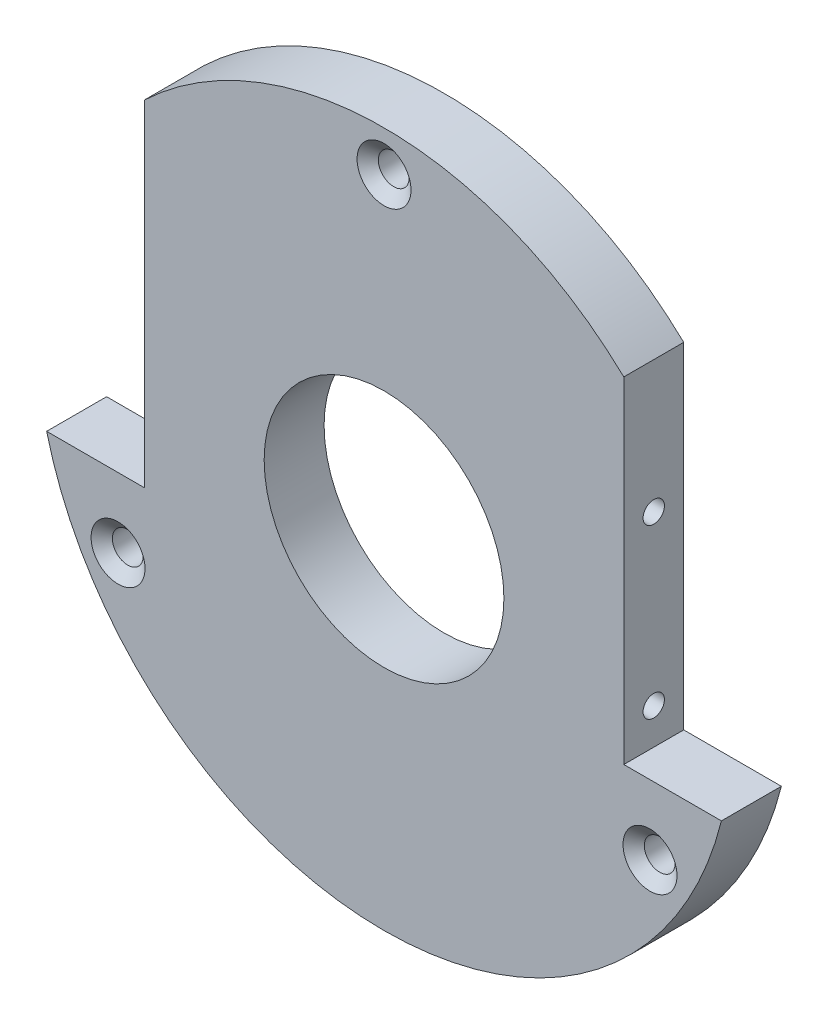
from build123d import *

# Parameters (mm, degrees)
SKETCH1_R                                         = 36.83
EXTRUDE1_DEPTH                                    = 6.35
CSK_FOR_4_FLAT_HEAD_MACHINE_SCREW_100_D           = 3.2639
CSK_FOR_4_FLAT_HEAD_MACHINE_SCREW_100_CSINK_D     = 5.715
CSK_FOR_4_FLAT_HEAD_MACHINE_SCREW_100_CSINK_ANGLE = 100
CIRPATTERN1_COUNT                                 = 3
EXTRUDE2_DEPTH                                    = 53.471137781
F_4_40_TAPPED_HOLE1_AT_2_COUNT                    = 2
F_4_40_TAPPED_HOLE1_AT_2_PITCH                    = 17.78
SKETCH6_R                                         = 12.7
EXTRUDE3_DEPTH                                    = 52.712553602


with BuildPart() as part:
    # Sketch1 → Extrude1 (new body)
    with BuildSketch(Plane.XY):
        Circle(SKETCH1_R)
    extrude(amount=EXTRUDE1_DEPTH)

    # CSK for _4 Flat Head Machine Screw _100 (through all)
    with Locations(Plane(origin=(0, 32.5374, 6.35), x_dir=(1, 0, 0), z_dir=(0, 0, 1))):
        with Locations((0, 0)):
            csk_for_4_flat_head_machine_screw_100 = CounterSinkHole(CSK_FOR_4_FLAT_HEAD_MACHINE_SCREW_100_D / 2, CSK_FOR_4_FLAT_HEAD_MACHINE_SCREW_100_CSINK_D / 2, counter_sink_angle=CSK_FOR_4_FLAT_HEAD_MACHINE_SCREW_100_CSINK_ANGLE)

    # CirPattern1: CSK for _4 Flat Head Machine Screw _100 ×3 about axis
    cirpattern1_axis = Axis((0, 0, 0), (0, 0, 1))
    for i in range(1, CIRPATTERN1_COUNT):
        add(csk_for_4_flat_head_machine_screw_100.rotate(cirpattern1_axis, i * 360 / CIRPATTERN1_COUNT), mode=Mode.SUBTRACT)

    # Sketch4 → Extrude2 (cut, through all)
    with BuildSketch(Plane.XY.offset(6.35)):
        Polygon((-27.94, -8.89), (-43.460792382, -8.89), (-43.460792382, 52.099906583), (40.845176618, 52.099906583), (40.845176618, -8.89), (27.94, -8.89), (25.4, -8.89), (25.4, 42.929114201), (-25.4, 42.929114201), (-25.4, -8.89), align=None)
    extrude(amount=-EXTRUDE2_DEPTH, mode=Mode.SUBTRACT)

    # Sketch5 → 4-40 Tapped Hole1 (revolve, cut)
    with BuildSketch(Plane(origin=(-25.4, -5.08, 3.175), x_dir=(0, 0, 1), z_dir=(0, 1, 0))):
        Polygon((0, 0), (0, 12.109152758), (1.1303, 11.43), (1.1303, 0), align=None)
    f_4_40_tapped_hole1 = revolve(axis=Axis((-31.75, -5.08, 3.175), (1, 0, 0)), mode=Mode.SUBTRACT)

    # 4-40 Tapped Hole1 at 2: 4-40 Tapped Hole1 ×2
    with Locations(*[(0, i * F_4_40_TAPPED_HOLE1_AT_2_PITCH, 0) for i in range(1, F_4_40_TAPPED_HOLE1_AT_2_COUNT)]):
        add(f_4_40_tapped_hole1, mode=Mode.SUBTRACT)

    # Mirror1: 4-40 Tapped Hole1 across plane
    add(f_4_40_tapped_hole1.mirror(Plane(origin=(0, 0, 0), x_dir=(0, 0, 1), z_dir=(1, 0, 0))), mode=Mode.SUBTRACT)

    # Mirror1 copy 1 sketch → Mirror1 copy 1 (revolve, cut)
    with BuildSketch(Plane(origin=(25.4, 12.7, 3.175), x_dir=(0, 0, 1), z_dir=(0, 1, 0))):
        Polygon((0, 0), (0, -12.109152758), (1.1303, -11.43), (1.1303, 0), align=None)
    revolve(axis=Axis((31.75, 12.7, 3.175), (1, 0, 0)), mode=Mode.SUBTRACT)

    # Sketch6 → Extrude3 (cut, through all)
    with BuildSketch(Plane(origin=(0, 0, 0), x_dir=(-1, 0, 0), z_dir=(0, 0, -1))):
        Circle(SKETCH6_R)
    extrude(amount=-EXTRUDE3_DEPTH, mode=Mode.SUBTRACT)


solid = part.part
